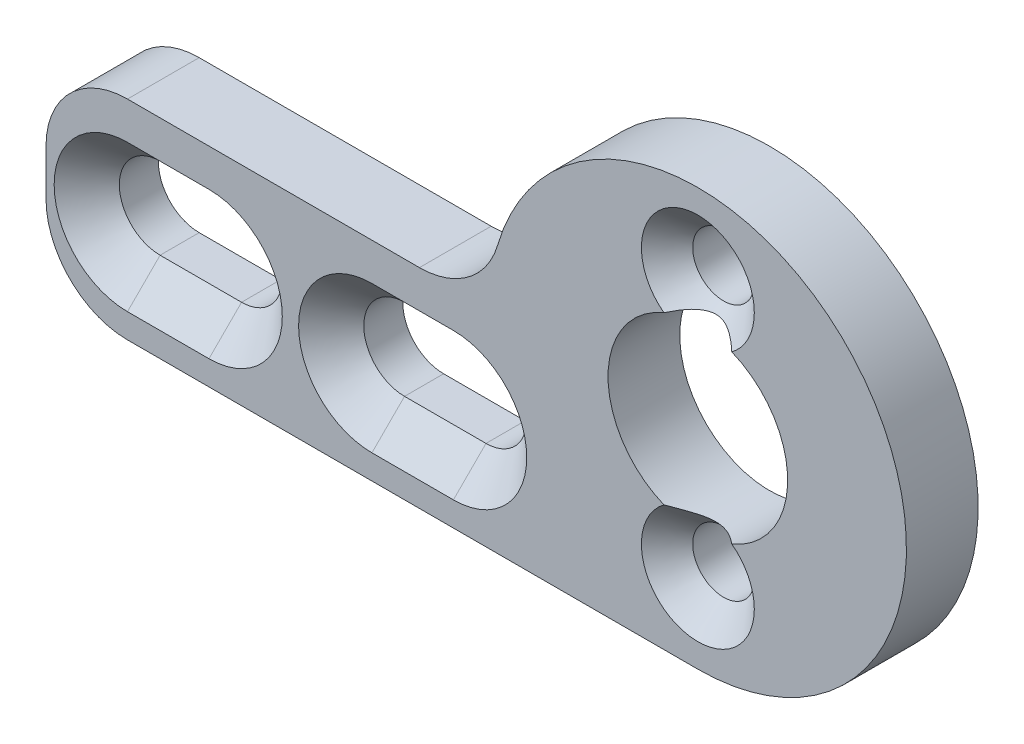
ISO-10303-21;
HEADER;
FILE_DESCRIPTION(('STEP AP214'),'2;1');
FILE_NAME('part.step','',(''),(''),'','','');
FILE_SCHEMA(('AUTOMOTIVE_DESIGN { 1 0 10303 214 1 1 1 1 }'));
ENDSEC;
DATA;
#1=APPLICATION_CONTEXT('core data for automotive mechanical design processes');
#2=APPLICATION_PROTOCOL_DEFINITION('international standard','automotive_design',2000,#1);
#3=PRODUCT_CONTEXT('',#1,'mechanical');
#4=PRODUCT('Part','Part','',(#3));
#5=PRODUCT_RELATED_PRODUCT_CATEGORY('part','',(#4));
#6=PRODUCT_DEFINITION_FORMATION('','',#4);
#7=PRODUCT_DEFINITION_CONTEXT('part definition',#1,'design');
#8=PRODUCT_DEFINITION('design','',#6,#7);
#9=PRODUCT_DEFINITION_SHAPE('','',#8);
#10=(LENGTH_UNIT() NAMED_UNIT(*) SI_UNIT(.MILLI.,.METRE.));
#11=(NAMED_UNIT(*) PLANE_ANGLE_UNIT() SI_UNIT($,.RADIAN.));
#12=(NAMED_UNIT(*) SI_UNIT($,.STERADIAN.) SOLID_ANGLE_UNIT());
#13=UNCERTAINTY_MEASURE_WITH_UNIT(LENGTH_MEASURE(1.E-05),#10,'distance_accuracy_value','');
#14=(GEOMETRIC_REPRESENTATION_CONTEXT(3) GLOBAL_UNCERTAINTY_ASSIGNED_CONTEXT((#13)) GLOBAL_UNIT_ASSIGNED_CONTEXT((#10,
#11,#12)) REPRESENTATION_CONTEXT('',''));
#15=CARTESIAN_POINT('',(0.,0.,0.));
#16=DIRECTION('',(0.,0.,1.));
#17=DIRECTION('',(1.,0.,0.));
#18=AXIS2_PLACEMENT_3D('',#15,#16,#17);
#19=CARTESIAN_POINT('',(0.,0.,2.794));
#20=DIRECTION('',(0.,0.,1.));
#21=DIRECTION('',(1.,0.,0.));
#22=AXIS2_PLACEMENT_3D('',#19,#20,#21);
#23=PLANE('',#22);
#24=CARTESIAN_POINT('',(-19.05,-4.318,2.794));
#25=DIRECTION('',(0.,0.,1.));
#26=DIRECTION('',(1.,0.,0.));
#27=AXIS2_PLACEMENT_3D('',#24,#25,#26);
#28=CIRCLE('',#27,2.85750000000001);
#29=CARTESIAN_POINT('',(-19.05,-1.46049999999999,2.794));
#30=VERTEX_POINT('',#29);
#31=CARTESIAN_POINT('',(-19.05,-7.17550000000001,2.794));
#32=VERTEX_POINT('',#31);
#33=EDGE_CURVE('E470',#30,#32,#28,.F.);
#34=ORIENTED_EDGE('',*,*,#33,.T.);
#35=DIRECTION('',(-1.,0.,0.));
#36=VECTOR('',#35,1.);
#37=CARTESIAN_POINT('',(-22.225,-7.17550000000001,2.794));
#38=LINE('',#37,#36);
#39=CARTESIAN_POINT('',(-22.225,-7.17550000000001,2.794));
#40=VERTEX_POINT('',#39);
#41=EDGE_CURVE('E467',#32,#40,#38,.T.);
#42=ORIENTED_EDGE('',*,*,#41,.T.);
#43=CARTESIAN_POINT('',(-22.225,-4.318,2.794));
#44=DIRECTION('',(0.,0.,1.));
#45=DIRECTION('',(1.,0.,0.));
#46=AXIS2_PLACEMENT_3D('',#43,#44,#45);
#47=CIRCLE('',#46,2.85750000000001);
#48=CARTESIAN_POINT('',(-22.225,-1.46049999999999,2.794));
#49=VERTEX_POINT('',#48);
#50=EDGE_CURVE('E472',#40,#49,#47,.F.);
#51=ORIENTED_EDGE('',*,*,#50,.T.);
#52=DIRECTION('',(1.,0.,0.));
#53=VECTOR('',#52,1.);
#54=CARTESIAN_POINT('',(-19.05,-1.46049999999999,2.794));
#55=LINE('',#54,#53);
#56=EDGE_CURVE('E474',#49,#30,#55,.T.);
#57=ORIENTED_EDGE('',*,*,#56,.T.);
#58=EDGE_LOOP('',(#34,#42,#51,#57));
#59=FACE_BOUND('',#58,.T.);
#60=CARTESIAN_POINT('',(-9.525,-4.318,2.794));
#61=DIRECTION('',(0.,0.,1.));
#62=DIRECTION('',(1.,0.,0.));
#63=AXIS2_PLACEMENT_3D('',#60,#61,#62);
#64=CIRCLE('',#63,2.85750000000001);
#65=CARTESIAN_POINT('',(-9.525,-1.46049999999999,2.794));
#66=VERTEX_POINT('',#65);
#67=CARTESIAN_POINT('',(-9.525,-7.17550000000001,2.794));
#68=VERTEX_POINT('',#67);
#69=EDGE_CURVE('E479',#66,#68,#64,.F.);
#70=ORIENTED_EDGE('',*,*,#69,.T.);
#71=DIRECTION('',(-1.,0.,0.));
#72=VECTOR('',#71,1.);
#73=CARTESIAN_POINT('',(-12.7,-7.17550000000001,2.794));
#74=LINE('',#73,#72);
#75=CARTESIAN_POINT('',(-12.7,-7.17550000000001,2.794));
#76=VERTEX_POINT('',#75);
#77=EDGE_CURVE('E476',#68,#76,#74,.T.);
#78=ORIENTED_EDGE('',*,*,#77,.T.);
#79=CARTESIAN_POINT('',(-12.7,-4.318,2.794));
#80=DIRECTION('',(0.,0.,1.));
#81=DIRECTION('',(1.,0.,0.));
#82=AXIS2_PLACEMENT_3D('',#79,#80,#81);
#83=CIRCLE('',#82,2.85750000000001);
#84=CARTESIAN_POINT('',(-12.7,-1.46049999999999,2.794));
#85=VERTEX_POINT('',#84);
#86=EDGE_CURVE('E481',#76,#85,#83,.F.);
#87=ORIENTED_EDGE('',*,*,#86,.T.);
#88=DIRECTION('',(1.,0.,0.));
#89=VECTOR('',#88,1.);
#90=CARTESIAN_POINT('',(-9.525,-1.46049999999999,2.794));
#91=LINE('',#90,#89);
#92=EDGE_CURVE('E483',#85,#66,#91,.T.);
#93=ORIENTED_EDGE('',*,*,#92,.T.);
#94=EDGE_LOOP('',(#70,#78,#87,#93));
#95=FACE_BOUND('',#94,.T.);
#96=CARTESIAN_POINT('',(0.,5.,2.794));
#97=DIRECTION('',(0.,0.,1.));
#98=DIRECTION('',(1.,0.,0.));
#99=AXIS2_PLACEMENT_3D('',#96,#97,#98);
#100=CIRCLE('',#99,2.2);
#101=CARTESIAN_POINT('',(1.32133228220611,3.241,2.794));
#102=VERTEX_POINT('',#101);
#103=CARTESIAN_POINT('',(-1.32133228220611,3.241,2.794));
#104=VERTEX_POINT('',#103);
#105=EDGE_CURVE('E247',#102,#104,#100,.T.);
#106=ORIENTED_EDGE('',*,*,#105,.F.);
#107=CARTESIAN_POINT('',(0.,0.,2.794));
#108=DIRECTION('',(0.,0.,1.));
#109=DIRECTION('',(1.,0.,0.));
#110=AXIS2_PLACEMENT_3D('',#107,#108,#109);
#111=CIRCLE('',#110,3.5);
#112=CARTESIAN_POINT('',(1.32133228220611,-3.241,2.794));
#113=VERTEX_POINT('',#112);
#114=EDGE_CURVE('E261',#113,#102,#111,.T.);
#115=ORIENTED_EDGE('',*,*,#114,.F.);
#116=CARTESIAN_POINT('',(0.,-5.,2.794));
#117=DIRECTION('',(0.,0.,1.));
#118=DIRECTION('',(1.,0.,0.));
#119=AXIS2_PLACEMENT_3D('',#116,#117,#118);
#120=CIRCLE('',#119,2.2);
#121=CARTESIAN_POINT('',(-1.32133228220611,-3.241,2.794));
#122=VERTEX_POINT('',#121);
#123=EDGE_CURVE('E255',#122,#113,#120,.T.);
#124=ORIENTED_EDGE('',*,*,#123,.F.);
#125=EDGE_CURVE('E260',#104,#122,#111,.T.);
#126=ORIENTED_EDGE('',*,*,#125,.F.);
#127=EDGE_LOOP('',(#106,#115,#124,#126));
#128=FACE_BOUND('',#127,.T.);
#129=DIRECTION('',(0.,-1.,0.));
#130=VECTOR('',#129,1.);
#131=CARTESIAN_POINT('',(-25.4,-8.128,2.794));
#132=LINE('',#131,#130);
#133=CARTESIAN_POINT('',(-25.4,-3.175,2.794));
#134=VERTEX_POINT('',#133);
#135=CARTESIAN_POINT('',(-25.4,-4.953,2.794));
#136=VERTEX_POINT('',#135);
#137=EDGE_CURVE('E278',#134,#136,#132,.T.);
#138=ORIENTED_EDGE('',*,*,#137,.T.);
#139=CARTESIAN_POINT('',(-22.225,-4.953,2.794));
#140=DIRECTION('',(0.,0.,1.));
#141=DIRECTION('',(1.,0.,0.));
#142=AXIS2_PLACEMENT_3D('',#139,#140,#141);
#143=CIRCLE('',#142,3.175);
#144=CARTESIAN_POINT('',(-22.225,-8.128,2.794));
#145=VERTEX_POINT('',#144);
#146=EDGE_CURVE('E423',#136,#145,#143,.T.);
#147=ORIENTED_EDGE('',*,*,#146,.T.);
#148=DIRECTION('',(1.,0.,0.));
#149=VECTOR('',#148,1.);
#150=CARTESIAN_POINT('',(0.,-8.128,2.794));
#151=LINE('',#150,#149);
#152=CARTESIAN_POINT('',(0.,-8.128,2.794));
#153=VERTEX_POINT('',#152);
#154=EDGE_CURVE('E281',#145,#153,#151,.T.);
#155=ORIENTED_EDGE('',*,*,#154,.T.);
#156=CARTESIAN_POINT('',(0.,0.,2.794));
#157=DIRECTION('',(0.,0.,1.));
#158=DIRECTION('',(1.,0.,0.));
#159=AXIS2_PLACEMENT_3D('',#156,#157,#158);
#160=CIRCLE('',#159,8.128);
#161=CARTESIAN_POINT('',(-7.8007453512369,2.28314606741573,2.794));
#162=VERTEX_POINT('',#161);
#163=EDGE_CURVE('E274',#153,#162,#160,.T.);
#164=ORIENTED_EDGE('',*,*,#163,.T.);
#165=CARTESIAN_POINT('',(-10.8479115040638,3.175,2.794));
#166=DIRECTION('',(0.,0.,1.));
#167=DIRECTION('',(1.,0.,0.));
#168=AXIS2_PLACEMENT_3D('',#165,#166,#167);
#169=CIRCLE('',#168,3.175);
#170=CARTESIAN_POINT('',(-10.8479115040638,0.,2.794));
#171=VERTEX_POINT('',#170);
#172=EDGE_CURVE('E13',#162,#171,#169,.F.);
#173=ORIENTED_EDGE('',*,*,#172,.T.);
#174=DIRECTION('',(-1.,0.,0.));
#175=VECTOR('',#174,1.);
#176=CARTESIAN_POINT('',(-25.4,0.,2.794));
#177=LINE('',#176,#175);
#178=CARTESIAN_POINT('',(-22.225,0.,2.794));
#179=VERTEX_POINT('',#178);
#180=EDGE_CURVE('E276',#171,#179,#177,.T.);
#181=ORIENTED_EDGE('',*,*,#180,.T.);
#182=CARTESIAN_POINT('',(-22.225,-3.175,2.794));
#183=DIRECTION('',(0.,0.,1.));
#184=DIRECTION('',(1.,0.,0.));
#185=AXIS2_PLACEMENT_3D('',#182,#183,#184);
#186=CIRCLE('',#185,3.175);
#187=EDGE_CURVE('E447',#179,#134,#186,.T.);
#188=ORIENTED_EDGE('',*,*,#187,.T.);
#189=EDGE_LOOP('',(#138,#147,#155,#164,#173,#181,#188));
#190=FACE_BOUND('',#189,.T.);
#191=ADVANCED_FACE('F41',(#59,#95,#128,#190),#23,.T.);
#192=CARTESIAN_POINT('',(0.,0.,0.));
#193=DIRECTION('',(0.,0.,1.));
#194=DIRECTION('',(1.,0.,0.));
#195=AXIS2_PLACEMENT_3D('',#192,#193,#194);
#196=PLANE('',#195);
#197=DIRECTION('',(-1.,0.,0.));
#198=VECTOR('',#197,1.);
#199=CARTESIAN_POINT('',(-12.7,-2.7305,0.));
#200=LINE('',#199,#198);
#201=CARTESIAN_POINT('',(-9.525,-2.7305,0.));
#202=VERTEX_POINT('',#201);
#203=CARTESIAN_POINT('',(-12.7,-2.7305,0.));
#204=VERTEX_POINT('',#203);
#205=EDGE_CURVE('E211',#202,#204,#200,.T.);
#206=ORIENTED_EDGE('',*,*,#205,.T.);
#207=CARTESIAN_POINT('',(-12.7,-4.318,0.));
#208=DIRECTION('',(0.,0.,1.));
#209=DIRECTION('',(-1.,0.,0.));
#210=AXIS2_PLACEMENT_3D('',#207,#208,#209);
#211=CIRCLE('',#210,1.5875);
#212=CARTESIAN_POINT('',(-12.7,-5.9055,0.));
#213=VERTEX_POINT('',#212);
#214=EDGE_CURVE('E202',#204,#213,#211,.T.);
#215=ORIENTED_EDGE('',*,*,#214,.T.);
#216=DIRECTION('',(1.,0.,0.));
#217=VECTOR('',#216,1.);
#218=CARTESIAN_POINT('',(-9.525,-5.9055,0.));
#219=LINE('',#218,#217);
#220=CARTESIAN_POINT('',(-9.525,-5.9055,0.));
#221=VERTEX_POINT('',#220);
#222=EDGE_CURVE('E185',#213,#221,#219,.T.);
#223=ORIENTED_EDGE('',*,*,#222,.T.);
#224=CARTESIAN_POINT('',(-9.525,-4.318,0.));
#225=DIRECTION('',(0.,0.,1.));
#226=DIRECTION('',(-1.,0.,0.));
#227=AXIS2_PLACEMENT_3D('',#224,#225,#226);
#228=CIRCLE('',#227,1.5875);
#229=EDGE_CURVE('E644',#221,#202,#228,.T.);
#230=ORIENTED_EDGE('',*,*,#229,.T.);
#231=EDGE_LOOP('',(#206,#215,#223,#230));
#232=FACE_BOUND('',#231,.T.);
#233=DIRECTION('',(-1.,0.,0.));
#234=VECTOR('',#233,1.);
#235=CARTESIAN_POINT('',(-22.225,-2.7305,0.));
#236=LINE('',#235,#234);
#237=CARTESIAN_POINT('',(-19.05,-2.7305,0.));
#238=VERTEX_POINT('',#237);
#239=CARTESIAN_POINT('',(-22.225,-2.7305,0.));
#240=VERTEX_POINT('',#239);
#241=EDGE_CURVE('E226',#238,#240,#236,.T.);
#242=ORIENTED_EDGE('',*,*,#241,.T.);
#243=CARTESIAN_POINT('',(-22.225,-4.318,0.));
#244=DIRECTION('',(0.,0.,1.));
#245=DIRECTION('',(-1.,0.,0.));
#246=AXIS2_PLACEMENT_3D('',#243,#244,#245);
#247=CIRCLE('',#246,1.5875);
#248=CARTESIAN_POINT('',(-22.225,-5.9055,0.));
#249=VERTEX_POINT('',#248);
#250=EDGE_CURVE('E212',#240,#249,#247,.T.);
#251=ORIENTED_EDGE('',*,*,#250,.T.);
#252=DIRECTION('',(1.,0.,0.));
#253=VECTOR('',#252,1.);
#254=CARTESIAN_POINT('',(-19.05,-5.9055,0.));
#255=LINE('',#254,#253);
#256=CARTESIAN_POINT('',(-19.05,-5.9055,0.));
#257=VERTEX_POINT('',#256);
#258=EDGE_CURVE('E215',#249,#257,#255,.T.);
#259=ORIENTED_EDGE('',*,*,#258,.T.);
#260=CARTESIAN_POINT('',(-19.05,-4.318,0.));
#261=DIRECTION('',(0.,0.,1.));
#262=DIRECTION('',(-1.,0.,0.));
#263=AXIS2_PLACEMENT_3D('',#260,#261,#262);
#264=CIRCLE('',#263,1.5875);
#265=EDGE_CURVE('E223',#257,#238,#264,.T.);
#266=ORIENTED_EDGE('',*,*,#265,.T.);
#267=EDGE_LOOP('',(#242,#251,#259,#266));
#268=FACE_BOUND('',#267,.T.);
#269=CARTESIAN_POINT('',(0.,5.,0.));
#270=DIRECTION('',(0.,0.,1.));
#271=DIRECTION('',(1.,0.,0.));
#272=AXIS2_PLACEMENT_3D('',#269,#270,#271);
#273=CIRCLE('',#272,1.2);
#274=CARTESIAN_POINT('',(1.2,5.,0.));
#275=VERTEX_POINT('',#274);
#276=EDGE_CURVE('E233',#275,#275,#273,.T.);
#277=ORIENTED_EDGE('',*,*,#276,.T.);
#278=EDGE_LOOP('',(#277));
#279=FACE_BOUND('',#278,.T.);
#280=CARTESIAN_POINT('',(0.,-5.,0.));
#281=DIRECTION('',(0.,0.,1.));
#282=DIRECTION('',(1.,0.,0.));
#283=AXIS2_PLACEMENT_3D('',#280,#281,#282);
#284=CIRCLE('',#283,1.2);
#285=CARTESIAN_POINT('',(1.2,-5.,0.));
#286=VERTEX_POINT('',#285);
#287=EDGE_CURVE('E249',#286,#286,#284,.T.);
#288=ORIENTED_EDGE('',*,*,#287,.T.);
#289=EDGE_LOOP('',(#288));
#290=FACE_BOUND('',#289,.T.);
#291=DIRECTION('',(1.,0.,0.));
#292=VECTOR('',#291,1.);
#293=CARTESIAN_POINT('',(0.,-8.128,0.));
#294=LINE('',#293,#292);
#295=CARTESIAN_POINT('',(-22.225,-8.128,0.));
#296=VERTEX_POINT('',#295);
#297=CARTESIAN_POINT('',(0.,-8.128,0.));
#298=VERTEX_POINT('',#297);
#299=EDGE_CURVE('E272',#296,#298,#294,.T.);
#300=ORIENTED_EDGE('',*,*,#299,.F.);
#301=CARTESIAN_POINT('',(-22.225,-4.953,0.));
#302=DIRECTION('',(0.,0.,1.));
#303=DIRECTION('',(1.,0.,0.));
#304=AXIS2_PLACEMENT_3D('',#301,#302,#303);
#305=CIRCLE('',#304,3.175);
#306=CARTESIAN_POINT('',(-25.4,-4.953,0.));
#307=VERTEX_POINT('',#306);
#308=EDGE_CURVE('E437',#296,#307,#305,.F.);
#309=ORIENTED_EDGE('',*,*,#308,.T.);
#310=DIRECTION('',(0.,-1.,0.));
#311=VECTOR('',#310,1.);
#312=CARTESIAN_POINT('',(-25.4,-8.128,0.));
#313=LINE('',#312,#311);
#314=CARTESIAN_POINT('',(-25.4,-3.175,0.));
#315=VERTEX_POINT('',#314);
#316=EDGE_CURVE('E269',#315,#307,#313,.T.);
#317=ORIENTED_EDGE('',*,*,#316,.F.);
#318=CARTESIAN_POINT('',(-22.225,-3.175,0.));
#319=DIRECTION('',(0.,0.,1.));
#320=DIRECTION('',(1.,0.,0.));
#321=AXIS2_PLACEMENT_3D('',#318,#319,#320);
#322=CIRCLE('',#321,3.175);
#323=CARTESIAN_POINT('',(-22.225,0.,0.));
#324=VERTEX_POINT('',#323);
#325=EDGE_CURVE('E440',#315,#324,#322,.F.);
#326=ORIENTED_EDGE('',*,*,#325,.T.);
#327=DIRECTION('',(-1.,0.,0.));
#328=VECTOR('',#327,1.);
#329=CARTESIAN_POINT('',(-25.4,0.,0.));
#330=LINE('',#329,#328);
#331=CARTESIAN_POINT('',(-10.8479115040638,0.,0.));
#332=VERTEX_POINT('',#331);
#333=EDGE_CURVE('E267',#332,#324,#330,.T.);
#334=ORIENTED_EDGE('',*,*,#333,.F.);
#335=CARTESIAN_POINT('',(-10.8479115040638,3.175,0.));
#336=DIRECTION('',(0.,0.,1.));
#337=DIRECTION('',(1.,0.,0.));
#338=AXIS2_PLACEMENT_3D('',#335,#336,#337);
#339=CIRCLE('',#338,3.175);
#340=CARTESIAN_POINT('',(-7.8007453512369,2.28314606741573,0.));
#341=VERTEX_POINT('',#340);
#342=EDGE_CURVE('E49',#332,#341,#339,.T.);
#343=ORIENTED_EDGE('',*,*,#342,.T.);
#344=CARTESIAN_POINT('',(0.,0.,0.));
#345=DIRECTION('',(0.,0.,1.));
#346=DIRECTION('',(1.,0.,0.));
#347=AXIS2_PLACEMENT_3D('',#344,#345,#346);
#348=CIRCLE('',#347,8.128);
#349=EDGE_CURVE('E264',#298,#341,#348,.T.);
#350=ORIENTED_EDGE('',*,*,#349,.F.);
#351=EDGE_LOOP('',(#300,#309,#317,#326,#334,#343,#350));
#352=FACE_BOUND('',#351,.T.);
#353=CARTESIAN_POINT('',(0.,0.,0.));
#354=DIRECTION('',(0.,0.,1.));
#355=DIRECTION('',(1.,0.,0.));
#356=AXIS2_PLACEMENT_3D('',#353,#354,#355);
#357=CIRCLE('',#356,3.5);
#358=CARTESIAN_POINT('',(3.5,0.,0.));
#359=VERTEX_POINT('',#358);
#360=EDGE_CURVE('E257',#359,#359,#357,.T.);
#361=ORIENTED_EDGE('',*,*,#360,.T.);
#362=EDGE_LOOP('',(#361));
#363=FACE_BOUND('',#362,.T.);
#364=ADVANCED_FACE('F208',(#232,#268,#279,#290,#352,#363),#196,.F.);
#365=CARTESIAN_POINT('',(0.,0.,2.794));
#366=DIRECTION('',(0.,0.,-1.));
#367=DIRECTION('',(-1.,0.,0.));
#368=AXIS2_PLACEMENT_3D('',#365,#366,#367);
#369=CYLINDRICAL_SURFACE('',#368,8.128);
#370=ORIENTED_EDGE('',*,*,#349,.T.);
#371=DIRECTION('',(0.,0.,-1.));
#372=VECTOR('',#371,1.);
#373=CARTESIAN_POINT('',(-7.8007453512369,2.28314606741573,2.794));
#374=LINE('',#373,#372);
#375=EDGE_CURVE('E420',#341,#162,#374,.F.);
#376=ORIENTED_EDGE('',*,*,#375,.T.);
#377=ORIENTED_EDGE('',*,*,#163,.F.);
#378=DIRECTION('',(0.,0.,-1.));
#379=VECTOR('',#378,1.);
#380=CARTESIAN_POINT('',(0.,-8.128,2.794));
#381=LINE('',#380,#379);
#382=EDGE_CURVE('E283',#153,#298,#381,.T.);
#383=ORIENTED_EDGE('',*,*,#382,.T.);
#384=EDGE_LOOP('',(#370,#376,#377,#383));
#385=FACE_BOUND('',#384,.T.);
#386=ADVANCED_FACE('F43',(#385),#369,.T.);
#387=CARTESIAN_POINT('',(-25.4,0.,2.794));
#388=DIRECTION('',(0.,-1.,0.));
#389=DIRECTION('',(0.,0.,-1.));
#390=AXIS2_PLACEMENT_3D('',#387,#388,#389);
#391=PLANE('',#390);
#392=ORIENTED_EDGE('',*,*,#180,.F.);
#393=DIRECTION('',(0.,0.,1.));
#394=VECTOR('',#393,1.);
#395=CARTESIAN_POINT('',(-10.8479115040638,0.,0.));
#396=LINE('',#395,#394);
#397=EDGE_CURVE('E417',#171,#332,#396,.F.);
#398=ORIENTED_EDGE('',*,*,#397,.T.);
#399=ORIENTED_EDGE('',*,*,#333,.T.);
#400=DIRECTION('',(0.,0.,-1.));
#401=VECTOR('',#400,1.);
#402=CARTESIAN_POINT('',(-22.225,0.,2.794));
#403=LINE('',#402,#401);
#404=EDGE_CURVE('E56',#324,#179,#403,.F.);
#405=ORIENTED_EDGE('',*,*,#404,.T.);
#406=EDGE_LOOP('',(#392,#398,#399,#405));
#407=FACE_BOUND('',#406,.T.);
#408=ADVANCED_FACE('F408',(#407),#391,.F.);
#409=CARTESIAN_POINT('',(-25.4,-8.128,2.794));
#410=DIRECTION('',(1.,0.,0.));
#411=DIRECTION('',(0.,0.,-1.));
#412=AXIS2_PLACEMENT_3D('',#409,#410,#411);
#413=PLANE('',#412);
#414=ORIENTED_EDGE('',*,*,#316,.T.);
#415=DIRECTION('',(0.,0.,-1.));
#416=VECTOR('',#415,1.);
#417=CARTESIAN_POINT('',(-25.4,-4.953,2.794));
#418=LINE('',#417,#416);
#419=EDGE_CURVE('E444',#307,#136,#418,.F.);
#420=ORIENTED_EDGE('',*,*,#419,.T.);
#421=ORIENTED_EDGE('',*,*,#137,.F.);
#422=DIRECTION('',(0.,0.,-1.));
#423=VECTOR('',#422,1.);
#424=CARTESIAN_POINT('',(-25.4,-3.175,2.794));
#425=LINE('',#424,#423);
#426=EDGE_CURVE('E439',#134,#315,#425,.T.);
#427=ORIENTED_EDGE('',*,*,#426,.T.);
#428=EDGE_LOOP('',(#414,#420,#421,#427));
#429=FACE_BOUND('',#428,.T.);
#430=ADVANCED_FACE('F405',(#429),#413,.F.);
#431=CARTESIAN_POINT('',(0.,-8.128,2.794));
#432=DIRECTION('',(0.,1.,0.));
#433=DIRECTION('',(-1.,0.,0.));
#434=AXIS2_PLACEMENT_3D('',#431,#432,#433);
#435=PLANE('',#434);
#436=ORIENTED_EDGE('',*,*,#154,.F.);
#437=DIRECTION('',(0.,0.,-1.));
#438=VECTOR('',#437,1.);
#439=CARTESIAN_POINT('',(-22.225,-8.128,2.794));
#440=LINE('',#439,#438);
#441=EDGE_CURVE('E435',#145,#296,#440,.T.);
#442=ORIENTED_EDGE('',*,*,#441,.T.);
#443=ORIENTED_EDGE('',*,*,#299,.T.);
#444=ORIENTED_EDGE('',*,*,#382,.F.);
#445=EDGE_LOOP('',(#436,#442,#443,#444));
#446=FACE_BOUND('',#445,.T.);
#447=ADVANCED_FACE('F402',(#446),#435,.F.);
#448=CARTESIAN_POINT('',(0.,0.,2.794));
#449=DIRECTION('',(0.,0.,-1.));
#450=DIRECTION('',(-1.,0.,0.));
#451=AXIS2_PLACEMENT_3D('',#448,#449,#450);
#452=CYLINDRICAL_SURFACE('',#451,3.5);
#453=CARTESIAN_POINT('',(-1.32154812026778,3.240911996,2.7942));
#454=CARTESIAN_POINT('',(-1.27500303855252,3.25988038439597,2.75111377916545));
#455=CARTESIAN_POINT('',(-1.22761484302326,3.27804549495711,2.70854773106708));
#456=CARTESIAN_POINT('',(-1.13072550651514,3.31272311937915,2.62488681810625));
#457=CARTESIAN_POINT('',(-1.08121876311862,3.32923080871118,2.58379645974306));
#458=CARTESIAN_POINT('',(-0.978721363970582,3.36081015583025,2.50281633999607));
#459=CARTESIAN_POINT('',(-0.925675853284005,3.37583832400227,2.46297837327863));
#460=CARTESIAN_POINT('',(-0.816826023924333,3.40381411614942,2.38657200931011));
#461=CARTESIAN_POINT('',(-0.761025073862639,3.41676420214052,2.3499997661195));
#462=CARTESIAN_POINT('',(-0.641845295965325,3.44122196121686,2.27897139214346));
#463=CARTESIAN_POINT('',(-0.578211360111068,3.45255154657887,2.24487309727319));
#464=CARTESIAN_POINT('',(-0.44695376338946,3.4719727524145,2.18496496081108));
#465=CARTESIAN_POINT('',(-0.379354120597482,3.48008193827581,2.15911031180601));
#466=CARTESIAN_POINT('',(-0.25283887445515,3.49132346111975,2.12273865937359));
#467=CARTESIAN_POINT('',(-0.194551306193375,3.49508901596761,2.11029821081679));
#468=CARTESIAN_POINT('',(-0.076620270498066,3.49965658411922,2.09516562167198));
#469=CARTESIAN_POINT('',(-0.0169786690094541,3.50046245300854,2.09246079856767));
#470=CARTESIAN_POINT('',(0.101832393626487,3.49902323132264,2.0972530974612));
#471=CARTESIAN_POINT('',(0.161001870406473,3.49677824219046,2.10474988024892));
#472=CARTESIAN_POINT('',(0.277347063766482,3.48948329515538,2.12870069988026));
#473=CARTESIAN_POINT('',(0.334518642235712,3.48442784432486,2.14517227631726));
#474=CARTESIAN_POINT('',(0.481814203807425,3.46790321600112,2.19774754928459));
#475=CARTESIAN_POINT('',(0.569577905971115,3.45440001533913,2.23966786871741));
#476=CARTESIAN_POINT('',(0.738298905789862,3.42233313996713,2.33438249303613));
#477=CARTESIAN_POINT('',(0.81921157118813,3.40373919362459,2.38724136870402));
#478=CARTESIAN_POINT('',(0.935227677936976,3.3729628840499,2.47046654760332));
#479=CARTESIAN_POINT('',(0.972523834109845,3.3623893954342,2.49844902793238));
#480=CARTESIAN_POINT('',(1.04591097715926,3.34029073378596,2.55560806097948));
#481=CARTESIAN_POINT('',(1.08200180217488,3.32876543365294,2.58478477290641));
#482=CARTESIAN_POINT('',(1.15254817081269,3.30499569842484,2.64360847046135));
#483=CARTESIAN_POINT('',(1.18702037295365,3.29276514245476,2.67324120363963));
#484=CARTESIAN_POINT('',(1.25498839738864,3.26746299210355,2.73322265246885));
#485=CARTESIAN_POINT('',(1.28848469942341,3.25439182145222,2.76357100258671));
#486=CARTESIAN_POINT('',(1.32154812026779,3.240911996,2.79420000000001));
#487=B_SPLINE_CURVE_WITH_KNOTS('',3,(#453,#454,#455,#456,#457,#458,#459,#460,#461,#462,#463,
#464,#465,#466,#467,#468,#469,#470,#471,#472,#473,#474,#475,#476,#477,#478,#479,#480,#481,#482,
#483,#484,#485,#486),.UNSPECIFIED.,.F.,.F.,(4,2,2,2,2,2,2,2,2,2,2,2,2,2,2,2,4),(0.,
0.198628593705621,0.397819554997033,0.601747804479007,0.805432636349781,1.02421647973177,
1.24179003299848,1.42018736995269,1.59835222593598,1.77651115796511,1.95501952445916,
2.24791659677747,2.54259466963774,2.6859943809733,2.82941327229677,2.9706140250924,
3.11174415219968),.UNSPECIFIED.);
#488=EDGE_CURVE('E294',#104,#102,#487,.T.);
#489=ORIENTED_EDGE('',*,*,#488,.F.);
#490=ORIENTED_EDGE('',*,*,#125,.T.);
#491=CARTESIAN_POINT('',(1.32154812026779,-3.240911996,2.79420000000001));
#492=CARTESIAN_POINT('',(1.27500303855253,-3.25988038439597,2.75111377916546));
#493=CARTESIAN_POINT('',(1.22761484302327,-3.27804549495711,2.70854773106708));
#494=CARTESIAN_POINT('',(1.13072550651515,-3.31272311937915,2.62488681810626));
#495=CARTESIAN_POINT('',(1.08121876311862,-3.32923080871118,2.58379645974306));
#496=CARTESIAN_POINT('',(0.97872136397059,-3.36081015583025,2.50281633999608));
#497=CARTESIAN_POINT('',(0.925675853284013,-3.37583832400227,2.46297837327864));
#498=CARTESIAN_POINT('',(0.816826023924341,-3.40381411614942,2.38657200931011));
#499=CARTESIAN_POINT('',(0.761025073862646,-3.41676420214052,2.3499997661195));
#500=CARTESIAN_POINT('',(0.641845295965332,-3.44122196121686,2.27897139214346));
#501=CARTESIAN_POINT('',(0.578211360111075,-3.45255154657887,2.24487309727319));
#502=CARTESIAN_POINT('',(0.446953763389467,-3.4719727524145,2.18496496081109));
#503=CARTESIAN_POINT('',(0.379354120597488,-3.48008193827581,2.15911031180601));
#504=CARTESIAN_POINT('',(0.252838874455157,-3.49132346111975,2.12273865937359));
#505=CARTESIAN_POINT('',(0.194551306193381,-3.49508901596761,2.11029821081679));
#506=CARTESIAN_POINT('',(0.076620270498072,-3.49965658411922,2.09516562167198));
#507=CARTESIAN_POINT('',(0.0169786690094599,-3.50046245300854,2.09246079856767));
#508=CARTESIAN_POINT('',(-0.101832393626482,-3.49902323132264,2.0972530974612));
#509=CARTESIAN_POINT('',(-0.161001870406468,-3.49677824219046,2.10474988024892));
#510=CARTESIAN_POINT('',(-0.277347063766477,-3.48948329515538,2.12870069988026));
#511=CARTESIAN_POINT('',(-0.334518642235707,-3.48442784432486,2.14517227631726));
#512=CARTESIAN_POINT('',(-0.48181420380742,-3.46790321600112,2.19774754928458));
#513=CARTESIAN_POINT('',(-0.569577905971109,-3.45440001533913,2.23966786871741));
#514=CARTESIAN_POINT('',(-0.738298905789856,-3.42233313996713,2.33438249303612));
#515=CARTESIAN_POINT('',(-0.819211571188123,-3.40373919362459,2.38724136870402));
#516=CARTESIAN_POINT('',(-0.935227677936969,-3.3729628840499,2.47046654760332));
#517=CARTESIAN_POINT('',(-0.972523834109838,-3.36238939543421,2.49844902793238));
#518=CARTESIAN_POINT('',(-1.04591097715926,-3.34029073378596,2.55560806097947));
#519=CARTESIAN_POINT('',(-1.08200180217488,-3.32876543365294,2.5847847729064));
#520=CARTESIAN_POINT('',(-1.15254817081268,-3.30499569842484,2.64360847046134));
#521=CARTESIAN_POINT('',(-1.18702037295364,-3.29276514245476,2.67324120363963));
#522=CARTESIAN_POINT('',(-1.25498839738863,-3.26746299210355,2.73322265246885));
#523=CARTESIAN_POINT('',(-1.2884846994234,-3.25439182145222,2.7635710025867));
#524=CARTESIAN_POINT('',(-1.32154812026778,-3.240911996,2.7942));
#525=B_SPLINE_CURVE_WITH_KNOTS('',3,(#491,#492,#493,#494,#495,#496,#497,#498,#499,#500,#501,
#502,#503,#504,#505,#506,#507,#508,#509,#510,#511,#512,#513,#514,#515,#516,#517,#518,#519,#520,
#521,#522,#523,#524),.UNSPECIFIED.,.F.,.F.,(4,2,2,2,2,2,2,2,2,2,2,2,2,2,2,2,4),(0.,
0.198628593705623,0.397819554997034,0.601747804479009,0.805432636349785,1.02421647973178,
1.24179003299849,1.42018736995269,1.59835222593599,1.77651115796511,1.95501952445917,
2.24791659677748,2.54259466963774,2.6859943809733,2.82941327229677,2.9706140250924,
3.11174415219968),.UNSPECIFIED.);
#526=EDGE_CURVE('E286',#113,#122,#525,.T.);
#527=ORIENTED_EDGE('',*,*,#526,.F.);
#528=ORIENTED_EDGE('',*,*,#114,.T.);
#529=EDGE_LOOP('',(#489,#490,#527,#528));
#530=FACE_BOUND('',#529,.T.);
#531=ORIENTED_EDGE('',*,*,#360,.F.);
#532=EDGE_LOOP('',(#531));
#533=FACE_BOUND('',#532,.T.);
#534=ADVANCED_FACE('F300',(#530,#533),#452,.F.);
#535=CARTESIAN_POINT('',(0.,-5.,2.794));
#536=DIRECTION('',(0.,0.,1.));
#537=DIRECTION('',(1.,0.,0.));
#538=AXIS2_PLACEMENT_3D('',#535,#536,#537);
#539=CONICAL_SURFACE('',#538,2.2,0.785398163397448);
#540=ORIENTED_EDGE('',*,*,#526,.T.);
#541=ORIENTED_EDGE('',*,*,#123,.T.);
#542=EDGE_LOOP('',(#540,#541));
#543=FACE_BOUND('',#542,.T.);
#544=CARTESIAN_POINT('',(0.,-5.,1.794));
#545=DIRECTION('',(0.,0.,1.));
#546=DIRECTION('',(1.,0.,0.));
#547=AXIS2_PLACEMENT_3D('',#544,#545,#546);
#548=CIRCLE('',#547,1.2);
#549=CARTESIAN_POINT('',(1.2,-5.,1.794));
#550=VERTEX_POINT('',#549);
#551=EDGE_CURVE('E252',#550,#550,#548,.T.);
#552=ORIENTED_EDGE('',*,*,#551,.F.);
#553=EDGE_LOOP('',(#552));
#554=FACE_BOUND('',#553,.T.);
#555=ADVANCED_FACE('F303',(#543,#554),#539,.F.);
#556=CARTESIAN_POINT('',(0.,-5.,2.794));
#557=DIRECTION('',(0.,0.,1.));
#558=DIRECTION('',(1.,0.,0.));
#559=AXIS2_PLACEMENT_3D('',#556,#557,#558);
#560=CYLINDRICAL_SURFACE('',#559,1.2);
#561=ORIENTED_EDGE('',*,*,#287,.F.);
#562=EDGE_LOOP('',(#561));
#563=FACE_BOUND('',#562,.T.);
#564=ORIENTED_EDGE('',*,*,#551,.T.);
#565=EDGE_LOOP('',(#564));
#566=FACE_BOUND('',#565,.T.);
#567=ADVANCED_FACE('F307',(#563,#566),#560,.F.);
#568=CARTESIAN_POINT('',(0.,5.,2.794));
#569=DIRECTION('',(0.,0.,1.));
#570=DIRECTION('',(1.,0.,0.));
#571=AXIS2_PLACEMENT_3D('',#568,#569,#570);
#572=CONICAL_SURFACE('',#571,2.2,0.785398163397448);
#573=ORIENTED_EDGE('',*,*,#488,.T.);
#574=ORIENTED_EDGE('',*,*,#105,.T.);
#575=EDGE_LOOP('',(#573,#574));
#576=FACE_BOUND('',#575,.T.);
#577=CARTESIAN_POINT('',(0.,5.,1.794));
#578=DIRECTION('',(0.,0.,1.));
#579=DIRECTION('',(1.,0.,0.));
#580=AXIS2_PLACEMENT_3D('',#577,#578,#579);
#581=CIRCLE('',#580,1.2);
#582=CARTESIAN_POINT('',(1.2,5.,1.794));
#583=VERTEX_POINT('',#582);
#584=EDGE_CURVE('E244',#583,#583,#581,.T.);
#585=ORIENTED_EDGE('',*,*,#584,.F.);
#586=EDGE_LOOP('',(#585));
#587=FACE_BOUND('',#586,.T.);
#588=ADVANCED_FACE('F310',(#576,#587),#572,.F.);
#589=CARTESIAN_POINT('',(0.,5.,2.794));
#590=DIRECTION('',(0.,0.,1.));
#591=DIRECTION('',(1.,0.,0.));
#592=AXIS2_PLACEMENT_3D('',#589,#590,#591);
#593=CYLINDRICAL_SURFACE('',#592,1.2);
#594=ORIENTED_EDGE('',*,*,#276,.F.);
#595=EDGE_LOOP('',(#594));
#596=FACE_BOUND('',#595,.T.);
#597=ORIENTED_EDGE('',*,*,#584,.T.);
#598=EDGE_LOOP('',(#597));
#599=FACE_BOUND('',#598,.T.);
#600=ADVANCED_FACE('F315',(#596,#599),#593,.F.);
#601=CARTESIAN_POINT('',(-22.225,-4.318,0.));
#602=DIRECTION('',(0.,0.,1.));
#603=DIRECTION('',(1.,0.,0.));
#604=AXIS2_PLACEMENT_3D('',#601,#602,#603);
#605=CYLINDRICAL_SURFACE('',#604,1.5875);
#606=DIRECTION('',(0.,0.,1.));
#607=VECTOR('',#606,1.);
#608=CARTESIAN_POINT('',(-22.225,-2.7305,0.));
#609=LINE('',#608,#607);
#610=CARTESIAN_POINT('',(-22.225,-2.7305,1.52399999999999));
#611=VERTEX_POINT('',#610);
#612=EDGE_CURVE('E230',#240,#611,#609,.T.);
#613=ORIENTED_EDGE('',*,*,#612,.T.);
#614=CARTESIAN_POINT('',(-22.225,-4.318,1.52399999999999));
#615=DIRECTION('',(0.,0.,1.));
#616=DIRECTION('',(1.,0.,0.));
#617=AXIS2_PLACEMENT_3D('',#614,#615,#616);
#618=CIRCLE('',#617,1.5875);
#619=CARTESIAN_POINT('',(-22.225,-5.9055,1.52399999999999));
#620=VERTEX_POINT('',#619);
#621=EDGE_CURVE('E463',#611,#620,#618,.T.);
#622=ORIENTED_EDGE('',*,*,#621,.T.);
#623=DIRECTION('',(0.,0.,1.));
#624=VECTOR('',#623,1.);
#625=CARTESIAN_POINT('',(-22.225,-5.9055,0.));
#626=LINE('',#625,#624);
#627=EDGE_CURVE('E229',#249,#620,#626,.T.);
#628=ORIENTED_EDGE('',*,*,#627,.F.);
#629=ORIENTED_EDGE('',*,*,#250,.F.);
#630=EDGE_LOOP('',(#613,#622,#628,#629));
#631=FACE_BOUND('',#630,.T.);
#632=ADVANCED_FACE('F319',(#631),#605,.F.);
#633=CARTESIAN_POINT('',(-22.225,-2.7305,0.));
#634=DIRECTION('',(0.,1.,0.));
#635=DIRECTION('',(0.,0.,1.));
#636=AXIS2_PLACEMENT_3D('',#633,#634,#635);
#637=PLANE('',#636);
#638=DIRECTION('',(0.,0.,1.));
#639=VECTOR('',#638,1.);
#640=CARTESIAN_POINT('',(-19.05,-2.7305,0.));
#641=LINE('',#640,#639);
#642=CARTESIAN_POINT('',(-19.05,-2.7305,1.52399999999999));
#643=VERTEX_POINT('',#642);
#644=EDGE_CURVE('E234',#238,#643,#641,.T.);
#645=ORIENTED_EDGE('',*,*,#644,.T.);
#646=DIRECTION('',(-1.,0.,0.));
#647=VECTOR('',#646,1.);
#648=CARTESIAN_POINT('',(-22.225,-2.7305,1.52399999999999));
#649=LINE('',#648,#647);
#650=EDGE_CURVE('E461',#643,#611,#649,.T.);
#651=ORIENTED_EDGE('',*,*,#650,.T.);
#652=ORIENTED_EDGE('',*,*,#612,.F.);
#653=ORIENTED_EDGE('',*,*,#241,.F.);
#654=EDGE_LOOP('',(#645,#651,#652,#653));
#655=FACE_BOUND('',#654,.T.);
#656=ADVANCED_FACE('F323',(#655),#637,.F.);
#657=CARTESIAN_POINT('',(-19.05,-4.318,0.));
#658=DIRECTION('',(0.,0.,1.));
#659=DIRECTION('',(1.,0.,0.));
#660=AXIS2_PLACEMENT_3D('',#657,#658,#659);
#661=CYLINDRICAL_SURFACE('',#660,1.5875);
#662=DIRECTION('',(0.,0.,1.));
#663=VECTOR('',#662,1.);
#664=CARTESIAN_POINT('',(-19.05,-5.9055,0.));
#665=LINE('',#664,#663);
#666=CARTESIAN_POINT('',(-19.05,-5.9055,1.52399999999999));
#667=VERTEX_POINT('',#666);
#668=EDGE_CURVE('E237',#257,#667,#665,.T.);
#669=ORIENTED_EDGE('',*,*,#668,.T.);
#670=CARTESIAN_POINT('',(-19.05,-4.318,1.52399999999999));
#671=DIRECTION('',(0.,0.,1.));
#672=DIRECTION('',(1.,0.,0.));
#673=AXIS2_PLACEMENT_3D('',#670,#671,#672);
#674=CIRCLE('',#673,1.5875);
#675=EDGE_CURVE('E465',#667,#643,#674,.T.);
#676=ORIENTED_EDGE('',*,*,#675,.T.);
#677=ORIENTED_EDGE('',*,*,#644,.F.);
#678=ORIENTED_EDGE('',*,*,#265,.F.);
#679=EDGE_LOOP('',(#669,#676,#677,#678));
#680=FACE_BOUND('',#679,.T.);
#681=ADVANCED_FACE('F328',(#680),#661,.F.);
#682=CARTESIAN_POINT('',(-19.05,-5.9055,0.));
#683=DIRECTION('',(0.,-1.,0.));
#684=DIRECTION('',(1.,0.,0.));
#685=AXIS2_PLACEMENT_3D('',#682,#683,#684);
#686=PLANE('',#685);
#687=ORIENTED_EDGE('',*,*,#627,.T.);
#688=DIRECTION('',(1.,0.,0.));
#689=VECTOR('',#688,1.);
#690=CARTESIAN_POINT('',(-19.05,-5.9055,1.52399999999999));
#691=LINE('',#690,#689);
#692=EDGE_CURVE('E484',#620,#667,#691,.T.);
#693=ORIENTED_EDGE('',*,*,#692,.T.);
#694=ORIENTED_EDGE('',*,*,#668,.F.);
#695=ORIENTED_EDGE('',*,*,#258,.F.);
#696=EDGE_LOOP('',(#687,#693,#694,#695));
#697=FACE_BOUND('',#696,.T.);
#698=ADVANCED_FACE('F325',(#697),#686,.F.);
#699=CARTESIAN_POINT('',(-12.7,-4.318,0.));
#700=DIRECTION('',(0.,0.,1.));
#701=DIRECTION('',(1.,0.,0.));
#702=AXIS2_PLACEMENT_3D('',#699,#700,#701);
#703=CYLINDRICAL_SURFACE('',#702,1.5875);
#704=DIRECTION('',(0.,0.,1.));
#705=VECTOR('',#704,1.);
#706=CARTESIAN_POINT('',(-12.7,-2.7305,0.));
#707=LINE('',#706,#705);
#708=CARTESIAN_POINT('',(-12.7,-2.7305,1.52399999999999));
#709=VERTEX_POINT('',#708);
#710=EDGE_CURVE('E217',#204,#709,#707,.T.);
#711=ORIENTED_EDGE('',*,*,#710,.T.);
#712=CARTESIAN_POINT('',(-12.7,-4.318,1.52399999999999));
#713=DIRECTION('',(0.,0.,1.));
#714=DIRECTION('',(1.,0.,0.));
#715=AXIS2_PLACEMENT_3D('',#712,#713,#714);
#716=CIRCLE('',#715,1.5875);
#717=CARTESIAN_POINT('',(-12.7,-5.9055,1.52399999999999));
#718=VERTEX_POINT('',#717);
#719=EDGE_CURVE('E205',#709,#718,#716,.T.);
#720=ORIENTED_EDGE('',*,*,#719,.T.);
#721=DIRECTION('',(0.,0.,1.));
#722=VECTOR('',#721,1.);
#723=CARTESIAN_POINT('',(-12.7,-5.9055,0.));
#724=LINE('',#723,#722);
#725=EDGE_CURVE('E189',#213,#718,#724,.T.);
#726=ORIENTED_EDGE('',*,*,#725,.F.);
#727=ORIENTED_EDGE('',*,*,#214,.F.);
#728=EDGE_LOOP('',(#711,#720,#726,#727));
#729=FACE_BOUND('',#728,.T.);
#730=ADVANCED_FACE('F201',(#729),#703,.F.);
#731=CARTESIAN_POINT('',(-12.7,-2.7305,0.));
#732=DIRECTION('',(0.,1.,0.));
#733=DIRECTION('',(0.,0.,1.));
#734=AXIS2_PLACEMENT_3D('',#731,#732,#733);
#735=PLANE('',#734);
#736=DIRECTION('',(0.,0.,1.));
#737=VECTOR('',#736,1.);
#738=CARTESIAN_POINT('',(-9.525,-2.7305,0.));
#739=LINE('',#738,#737);
#740=CARTESIAN_POINT('',(-9.525,-2.7305,1.52399999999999));
#741=VERTEX_POINT('',#740);
#742=EDGE_CURVE('E206',#202,#741,#739,.T.);
#743=ORIENTED_EDGE('',*,*,#742,.T.);
#744=DIRECTION('',(-1.,0.,0.));
#745=VECTOR('',#744,1.);
#746=CARTESIAN_POINT('',(-12.7,-2.7305,1.52399999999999));
#747=LINE('',#746,#745);
#748=EDGE_CURVE('E452',#741,#709,#747,.T.);
#749=ORIENTED_EDGE('',*,*,#748,.T.);
#750=ORIENTED_EDGE('',*,*,#710,.F.);
#751=ORIENTED_EDGE('',*,*,#205,.F.);
#752=EDGE_LOOP('',(#743,#749,#750,#751));
#753=FACE_BOUND('',#752,.T.);
#754=ADVANCED_FACE('F338',(#753),#735,.F.);
#755=CARTESIAN_POINT('',(-9.525,-4.318,0.));
#756=DIRECTION('',(0.,0.,1.));
#757=DIRECTION('',(1.,0.,0.));
#758=AXIS2_PLACEMENT_3D('',#755,#756,#757);
#759=CYLINDRICAL_SURFACE('',#758,1.5875);
#760=DIRECTION('',(0.,0.,1.));
#761=VECTOR('',#760,1.);
#762=CARTESIAN_POINT('',(-9.525,-5.9055,0.));
#763=LINE('',#762,#761);
#764=CARTESIAN_POINT('',(-9.525,-5.9055,1.52399999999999));
#765=VERTEX_POINT('',#764);
#766=EDGE_CURVE('E192',#221,#765,#763,.T.);
#767=ORIENTED_EDGE('',*,*,#766,.T.);
#768=CARTESIAN_POINT('',(-9.525,-4.318,1.52399999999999));
#769=DIRECTION('',(0.,0.,1.));
#770=DIRECTION('',(1.,0.,0.));
#771=AXIS2_PLACEMENT_3D('',#768,#769,#770);
#772=CIRCLE('',#771,1.5875);
#773=EDGE_CURVE('E457',#765,#741,#772,.T.);
#774=ORIENTED_EDGE('',*,*,#773,.T.);
#775=ORIENTED_EDGE('',*,*,#742,.F.);
#776=ORIENTED_EDGE('',*,*,#229,.F.);
#777=EDGE_LOOP('',(#767,#774,#775,#776));
#778=FACE_BOUND('',#777,.T.);
#779=ADVANCED_FACE('F342',(#778),#759,.F.);
#780=CARTESIAN_POINT('',(-9.525,-5.9055,0.));
#781=DIRECTION('',(0.,-1.,0.));
#782=DIRECTION('',(1.,0.,0.));
#783=AXIS2_PLACEMENT_3D('',#780,#781,#782);
#784=PLANE('',#783);
#785=ORIENTED_EDGE('',*,*,#725,.T.);
#786=DIRECTION('',(1.,0.,0.));
#787=VECTOR('',#786,1.);
#788=CARTESIAN_POINT('',(-9.525,-5.9055,1.52399999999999));
#789=LINE('',#788,#787);
#790=EDGE_CURVE('E459',#718,#765,#789,.T.);
#791=ORIENTED_EDGE('',*,*,#790,.T.);
#792=ORIENTED_EDGE('',*,*,#766,.F.);
#793=ORIENTED_EDGE('',*,*,#222,.F.);
#794=EDGE_LOOP('',(#785,#791,#792,#793));
#795=FACE_BOUND('',#794,.T.);
#796=ADVANCED_FACE('F187',(#795),#784,.F.);
#797=CARTESIAN_POINT('',(-22.225,-2.7305,1.52399999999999));
#798=DIRECTION('',(0.,-0.707106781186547,0.707106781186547));
#799=DIRECTION('',(0.,-0.707106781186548,-0.707106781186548));
#800=AXIS2_PLACEMENT_3D('',#797,#798,#799);
#801=PLANE('',#800);
#802=DIRECTION('',(0.,-0.707106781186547,-0.707106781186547));
#803=VECTOR('',#802,1.);
#804=CARTESIAN_POINT('',(-19.05,-1.46049999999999,2.794));
#805=LINE('',#804,#803);
#806=EDGE_CURVE('E631',#30,#643,#805,.T.);
#807=ORIENTED_EDGE('',*,*,#806,.F.);
#808=ORIENTED_EDGE('',*,*,#56,.F.);
#809=DIRECTION('',(0.,0.707106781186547,0.707106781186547));
#810=VECTOR('',#809,1.);
#811=CARTESIAN_POINT('',(-22.225,-2.7305,1.52399999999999));
#812=LINE('',#811,#810);
#813=EDGE_CURVE('E196',#611,#49,#812,.T.);
#814=ORIENTED_EDGE('',*,*,#813,.F.);
#815=ORIENTED_EDGE('',*,*,#650,.F.);
#816=EDGE_LOOP('',(#807,#808,#814,#815));
#817=FACE_BOUND('',#816,.T.);
#818=ADVANCED_FACE('F339',(#817),#801,.T.);
#819=CARTESIAN_POINT('',(-22.225,-4.318,1.52399999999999));
#820=DIRECTION('',(0.,0.,1.));
#821=DIRECTION('',(1.,0.,0.));
#822=AXIS2_PLACEMENT_3D('',#819,#820,#821);
#823=CONICAL_SURFACE('',#822,1.5875,0.785398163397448);
#824=ORIENTED_EDGE('',*,*,#813,.T.);
#825=ORIENTED_EDGE('',*,*,#50,.F.);
#826=DIRECTION('',(0.,-0.707106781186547,0.707106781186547));
#827=VECTOR('',#826,1.);
#828=CARTESIAN_POINT('',(-22.225,-5.9055,1.52399999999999));
#829=LINE('',#828,#827);
#830=EDGE_CURVE('E629',#620,#40,#829,.T.);
#831=ORIENTED_EDGE('',*,*,#830,.F.);
#832=ORIENTED_EDGE('',*,*,#621,.F.);
#833=EDGE_LOOP('',(#824,#825,#831,#832));
#834=FACE_BOUND('',#833,.T.);
#835=ADVANCED_FACE('F351',(#834),#823,.F.);
#836=CARTESIAN_POINT('',(-19.05,-4.318,1.52399999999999));
#837=DIRECTION('',(0.,0.,1.));
#838=DIRECTION('',(1.,0.,0.));
#839=AXIS2_PLACEMENT_3D('',#836,#837,#838);
#840=CONICAL_SURFACE('',#839,1.5875,0.785398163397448);
#841=ORIENTED_EDGE('',*,*,#806,.T.);
#842=ORIENTED_EDGE('',*,*,#675,.F.);
#843=DIRECTION('',(0.,0.707106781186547,-0.707106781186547));
#844=VECTOR('',#843,1.);
#845=CARTESIAN_POINT('',(-19.05,-7.17550000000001,2.794));
#846=LINE('',#845,#844);
#847=EDGE_CURVE('E632',#32,#667,#846,.T.);
#848=ORIENTED_EDGE('',*,*,#847,.F.);
#849=ORIENTED_EDGE('',*,*,#33,.F.);
#850=EDGE_LOOP('',(#841,#842,#848,#849));
#851=FACE_BOUND('',#850,.T.);
#852=ADVANCED_FACE('F355',(#851),#840,.F.);
#853=CARTESIAN_POINT('',(-19.05,-5.9055,1.52399999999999));
#854=DIRECTION('',(0.,0.707106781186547,0.707106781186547));
#855=DIRECTION('',(0.,-0.707106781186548,0.707106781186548));
#856=AXIS2_PLACEMENT_3D('',#853,#854,#855);
#857=PLANE('',#856);
#858=ORIENTED_EDGE('',*,*,#830,.T.);
#859=ORIENTED_EDGE('',*,*,#41,.F.);
#860=ORIENTED_EDGE('',*,*,#847,.T.);
#861=ORIENTED_EDGE('',*,*,#692,.F.);
#862=EDGE_LOOP('',(#858,#859,#860,#861));
#863=FACE_BOUND('',#862,.T.);
#864=ADVANCED_FACE('F359',(#863),#857,.T.);
#865=CARTESIAN_POINT('',(-12.7,-2.7305,1.52399999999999));
#866=DIRECTION('',(0.,-0.707106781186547,0.707106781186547));
#867=DIRECTION('',(0.,-0.707106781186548,-0.707106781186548));
#868=AXIS2_PLACEMENT_3D('',#865,#866,#867);
#869=PLANE('',#868);
#870=DIRECTION('',(0.,-0.707106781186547,-0.707106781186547));
#871=VECTOR('',#870,1.);
#872=CARTESIAN_POINT('',(-9.525,-1.46049999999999,2.794));
#873=LINE('',#872,#871);
#874=EDGE_CURVE('E652',#66,#741,#873,.T.);
#875=ORIENTED_EDGE('',*,*,#874,.F.);
#876=ORIENTED_EDGE('',*,*,#92,.F.);
#877=DIRECTION('',(0.,0.707106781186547,0.707106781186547));
#878=VECTOR('',#877,1.);
#879=CARTESIAN_POINT('',(-12.7,-2.7305,1.52399999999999));
#880=LINE('',#879,#878);
#881=EDGE_CURVE('E636',#709,#85,#880,.T.);
#882=ORIENTED_EDGE('',*,*,#881,.F.);
#883=ORIENTED_EDGE('',*,*,#748,.F.);
#884=EDGE_LOOP('',(#875,#876,#882,#883));
#885=FACE_BOUND('',#884,.T.);
#886=ADVANCED_FACE('F363',(#885),#869,.T.);
#887=CARTESIAN_POINT('',(-12.7,-4.318,1.52399999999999));
#888=DIRECTION('',(0.,0.,1.));
#889=DIRECTION('',(1.,0.,0.));
#890=AXIS2_PLACEMENT_3D('',#887,#888,#889);
#891=CONICAL_SURFACE('',#890,1.5875,0.785398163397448);
#892=ORIENTED_EDGE('',*,*,#881,.T.);
#893=ORIENTED_EDGE('',*,*,#86,.F.);
#894=DIRECTION('',(0.,-0.707106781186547,0.707106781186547));
#895=VECTOR('',#894,1.);
#896=CARTESIAN_POINT('',(-12.7,-5.9055,1.52399999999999));
#897=LINE('',#896,#895);
#898=EDGE_CURVE('E653',#718,#76,#897,.T.);
#899=ORIENTED_EDGE('',*,*,#898,.F.);
#900=ORIENTED_EDGE('',*,*,#719,.F.);
#901=EDGE_LOOP('',(#892,#893,#899,#900));
#902=FACE_BOUND('',#901,.T.);
#903=ADVANCED_FACE('F367',(#902),#891,.F.);
#904=CARTESIAN_POINT('',(-9.525,-4.318,1.52399999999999));
#905=DIRECTION('',(0.,0.,1.));
#906=DIRECTION('',(1.,0.,0.));
#907=AXIS2_PLACEMENT_3D('',#904,#905,#906);
#908=CONICAL_SURFACE('',#907,1.5875,0.785398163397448);
#909=ORIENTED_EDGE('',*,*,#874,.T.);
#910=ORIENTED_EDGE('',*,*,#773,.F.);
#911=DIRECTION('',(0.,0.707106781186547,-0.707106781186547));
#912=VECTOR('',#911,1.);
#913=CARTESIAN_POINT('',(-9.525,-7.17550000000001,2.794));
#914=LINE('',#913,#912);
#915=EDGE_CURVE('E656',#68,#765,#914,.T.);
#916=ORIENTED_EDGE('',*,*,#915,.F.);
#917=ORIENTED_EDGE('',*,*,#69,.F.);
#918=EDGE_LOOP('',(#909,#910,#916,#917));
#919=FACE_BOUND('',#918,.T.);
#920=ADVANCED_FACE('F371',(#919),#908,.F.);
#921=CARTESIAN_POINT('',(-9.525,-5.9055,1.52399999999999));
#922=DIRECTION('',(0.,0.707106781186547,0.707106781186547));
#923=DIRECTION('',(0.,-0.707106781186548,0.707106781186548));
#924=AXIS2_PLACEMENT_3D('',#921,#922,#923);
#925=PLANE('',#924);
#926=ORIENTED_EDGE('',*,*,#898,.T.);
#927=ORIENTED_EDGE('',*,*,#77,.F.);
#928=ORIENTED_EDGE('',*,*,#915,.T.);
#929=ORIENTED_EDGE('',*,*,#790,.F.);
#930=EDGE_LOOP('',(#926,#927,#928,#929));
#931=FACE_BOUND('',#930,.T.);
#932=ADVANCED_FACE('F375',(#931),#925,.T.);
#933=CARTESIAN_POINT('',(-22.225,-4.953,2.794));
#934=DIRECTION('',(0.,0.,-1.));
#935=DIRECTION('',(-1.,0.,0.));
#936=AXIS2_PLACEMENT_3D('',#933,#934,#935);
#937=CYLINDRICAL_SURFACE('',#936,3.175);
#938=ORIENTED_EDGE('',*,*,#146,.F.);
#939=ORIENTED_EDGE('',*,*,#419,.F.);
#940=ORIENTED_EDGE('',*,*,#308,.F.);
#941=ORIENTED_EDGE('',*,*,#441,.F.);
#942=EDGE_LOOP('',(#938,#939,#940,#941));
#943=FACE_BOUND('',#942,.T.);
#944=ADVANCED_FACE('F379',(#943),#937,.T.);
#945=CARTESIAN_POINT('',(-10.8479115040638,3.175,2.794));
#946=DIRECTION('',(0.,0.,-1.));
#947=DIRECTION('',(-1.,0.,0.));
#948=AXIS2_PLACEMENT_3D('',#945,#946,#947);
#949=CYLINDRICAL_SURFACE('',#948,3.175);
#950=ORIENTED_EDGE('',*,*,#172,.F.);
#951=ORIENTED_EDGE('',*,*,#375,.F.);
#952=ORIENTED_EDGE('',*,*,#342,.F.);
#953=ORIENTED_EDGE('',*,*,#397,.F.);
#954=EDGE_LOOP('',(#950,#951,#952,#953));
#955=FACE_BOUND('',#954,.T.);
#956=ADVANCED_FACE('F383',(#955),#949,.F.);
#957=CARTESIAN_POINT('',(-22.225,-3.175,2.794));
#958=DIRECTION('',(0.,0.,-1.));
#959=DIRECTION('',(-1.,0.,0.));
#960=AXIS2_PLACEMENT_3D('',#957,#958,#959);
#961=CYLINDRICAL_SURFACE('',#960,3.175);
#962=ORIENTED_EDGE('',*,*,#187,.F.);
#963=ORIENTED_EDGE('',*,*,#404,.F.);
#964=ORIENTED_EDGE('',*,*,#325,.F.);
#965=ORIENTED_EDGE('',*,*,#426,.F.);
#966=EDGE_LOOP('',(#962,#963,#964,#965));
#967=FACE_BOUND('',#966,.T.);
#968=ADVANCED_FACE('F387',(#967),#961,.T.);
#969=CLOSED_SHELL('',(#191,#364,#386,#408,#430,#447,#534,#555,#567,#588,#600,#632,#656,#681,
#698,#730,#754,#779,#796,#818,#835,#852,#864,#886,#903,#920,#932,#944,#956,#968));
#970=MANIFOLD_SOLID_BREP('B2',#969);
#971=ADVANCED_BREP_SHAPE_REPRESENTATION('',(#18,#970),#14);
#972=SHAPE_DEFINITION_REPRESENTATION(#9,#971);
ENDSEC;
END-ISO-10303-21;
